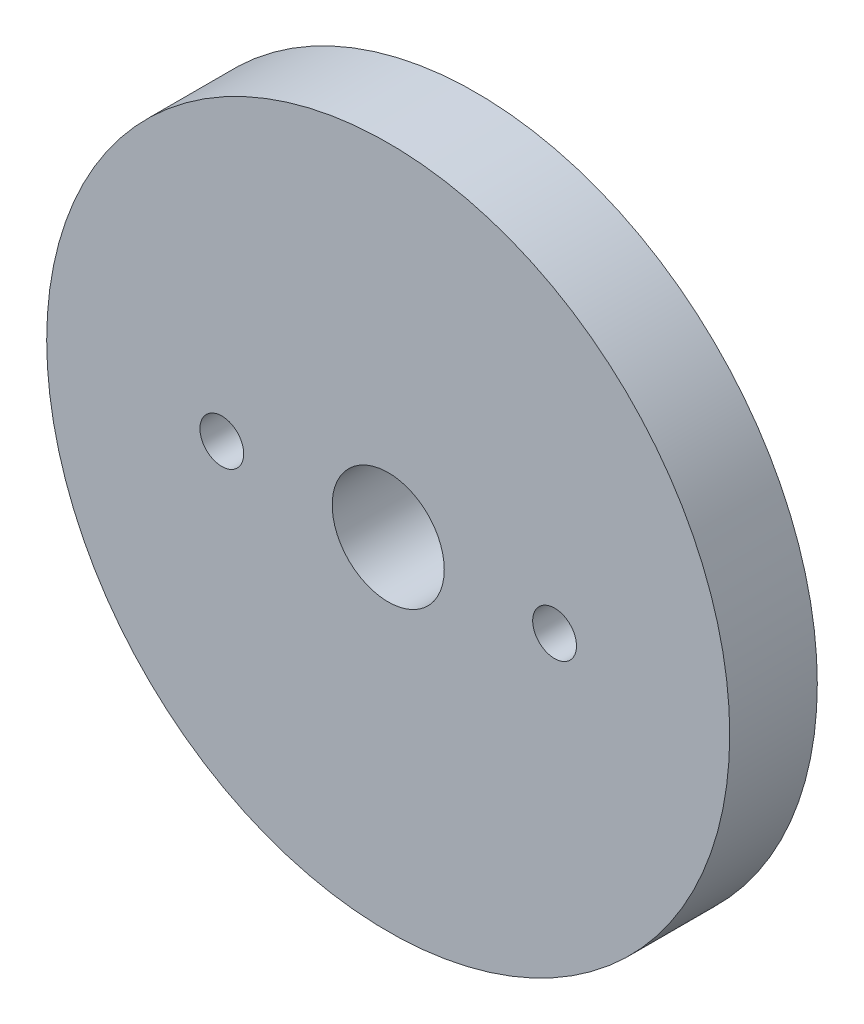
from build123d import *

# Parameters (mm, degrees)
ESQUISSE1_R          = 19.5
ESQUISSE1_R_2        = 1.25
ESQUISSE1_R_3        = 3.2
BASE_EXTRUSION_DEPTH = 5


with BuildPart() as part:
    # Esquisse1 → Base-Extrusion (new body)
    with BuildSketch(Plane(origin=(0, 0, -5), x_dir=(-1, 0, 0), z_dir=(0, 0, -1))):
        with Locations(Location((0, 0, 0), (0, 0, 180))):
            Circle(ESQUISSE1_R)
        with Locations(Location((-9.5, 0, 0), (0, 0, 180))):
            Circle(ESQUISSE1_R_2, mode=Mode.SUBTRACT)
        with Locations(Location((9.5, 0, 0), (0, 0, 180))):
            Circle(ESQUISSE1_R_2, mode=Mode.SUBTRACT)
        with Locations(Location((0, 0, 0), (0, 0, 180))):
            Circle(ESQUISSE1_R_3, mode=Mode.SUBTRACT)
    extrude(amount=-BASE_EXTRUSION_DEPTH)


solid = part.part
